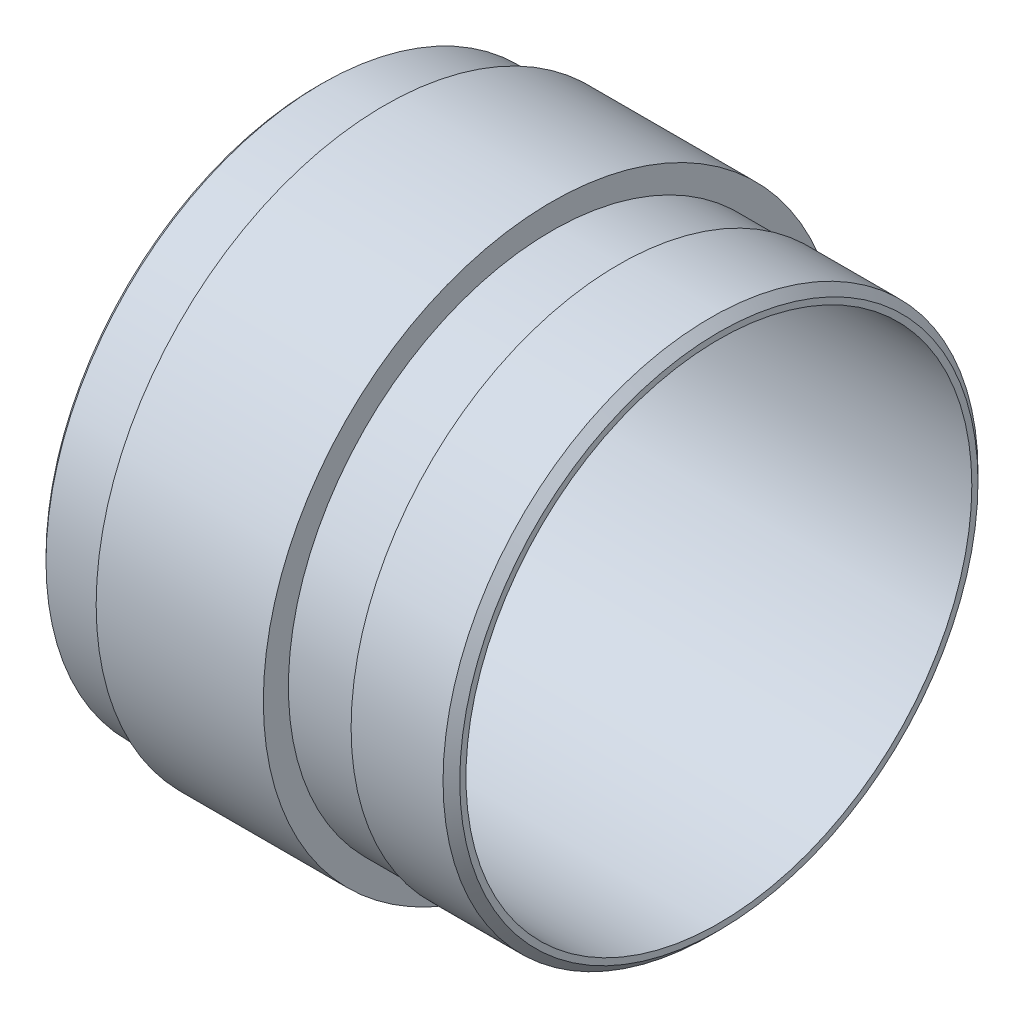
from build123d import *

# Parameters (mm, degrees)
SKETCH1_R           = 109.5375
SKETCH1_R_2         = 96.0755
BOSS_EXTRUDE1_DEPTH = 152.4
SKETCH2_W           = 25.4
SKETCH2_H           = 7.056427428
SKETCH3_R           = 112.402993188
SKETCH3_R_2         = 104.775
CUT_EXTRUDE1_DEPTH  = 12.7
CHAMFER2_SIZE       = 1.5875
SKETCH4_R           = 123.253131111
SKETCH4_R_2         = 101.6
CUT_EXTRUDE2_DEPTH  = 63.5
CHAMFER3_SIZE       = 3.175
SKETCH5_R           = 118.488329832
SKETCH5_R_2         = 100.0125
CUT_EXTRUDE3_DEPTH  = 25.4
SKETCH7_R           = 112.522136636
SKETCH7_R_2         = 104.775
SUPT_RING_CUT_DEPTH = 12.7


with BuildPart() as part:
    # Sketch1 → Boss-Extrude1 (new body)
    with BuildSketch(Plane(origin=(0, 0, 0), x_dir=(0, 0, -1), z_dir=(1, 0, 0))):
        Circle(SKETCH1_R)
        Circle(SKETCH1_R_2, mode=Mode.SUBTRACT)
    extrude(amount=BOSS_EXTRUDE1_DEPTH)

    # Sketch2 → Cut-Revolve1 (revolve, cut)
    with BuildSketch(Plane(origin=(0, 0, 0), x_dir=(1, 0, 0), z_dir=(0, 1, 0))):
        with Locations((101.6, 110.433089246)):
            Rectangle(SKETCH2_W, SKETCH2_H)
    revolve(axis=Axis((0, 0, 0), (-1, 0, 0)), mode=Mode.SUBTRACT)

    # Sketch3 → Cut-Extrude1 (cut)
    with BuildSketch(Plane.ZY):
        Circle(SKETCH3_R)
        Circle(SKETCH3_R_2, mode=Mode.SUBTRACT)
    extrude(amount=-CUT_EXTRUDE1_DEPTH, mode=Mode.SUBTRACT)

    # Chamfer2
    chamfer2_edges = [part.edges().sort_by_distance(p)[0] for p in [
        (0, 0, -104.775),
    ]]
    chamfer(chamfer2_edges, length=CHAMFER2_SIZE)

    # Sketch4 → Cut-Extrude2 (cut)
    with BuildSketch(Plane(origin=(152.4, 0, 0), x_dir=(0, 0, -1), z_dir=(1, 0, 0))):
        Circle(SKETCH4_R)
        Circle(SKETCH4_R_2, mode=Mode.SUBTRACT)
    extrude(amount=-CUT_EXTRUDE2_DEPTH, mode=Mode.SUBTRACT)

    # Chamfer3
    chamfer3_edges = [part.edges().sort_by_distance(p)[0] for p in [
        (152.4, 0, 101.6),
    ]]
    chamfer(chamfer3_edges, length=CHAMFER3_SIZE)

    # Sketch5 → Cut-Extrude3 (cut)
    with BuildSketch(Plane(origin=(88.9, 0, 0), x_dir=(0, 0, -1), z_dir=(1, 0, 0))):
        Circle(SKETCH5_R)
        Circle(SKETCH5_R_2, mode=Mode.SUBTRACT)
    extrude(amount=CUT_EXTRUDE3_DEPTH, mode=Mode.SUBTRACT)

    # Sketch7 → supt ring cut (cut)
    with BuildSketch(Plane.ZY.offset(-12.7)):
        Circle(SKETCH7_R)
        Circle(SKETCH7_R_2, mode=Mode.SUBTRACT)
    extrude(amount=-SUPT_RING_CUT_DEPTH, mode=Mode.SUBTRACT)


solid = part.part
